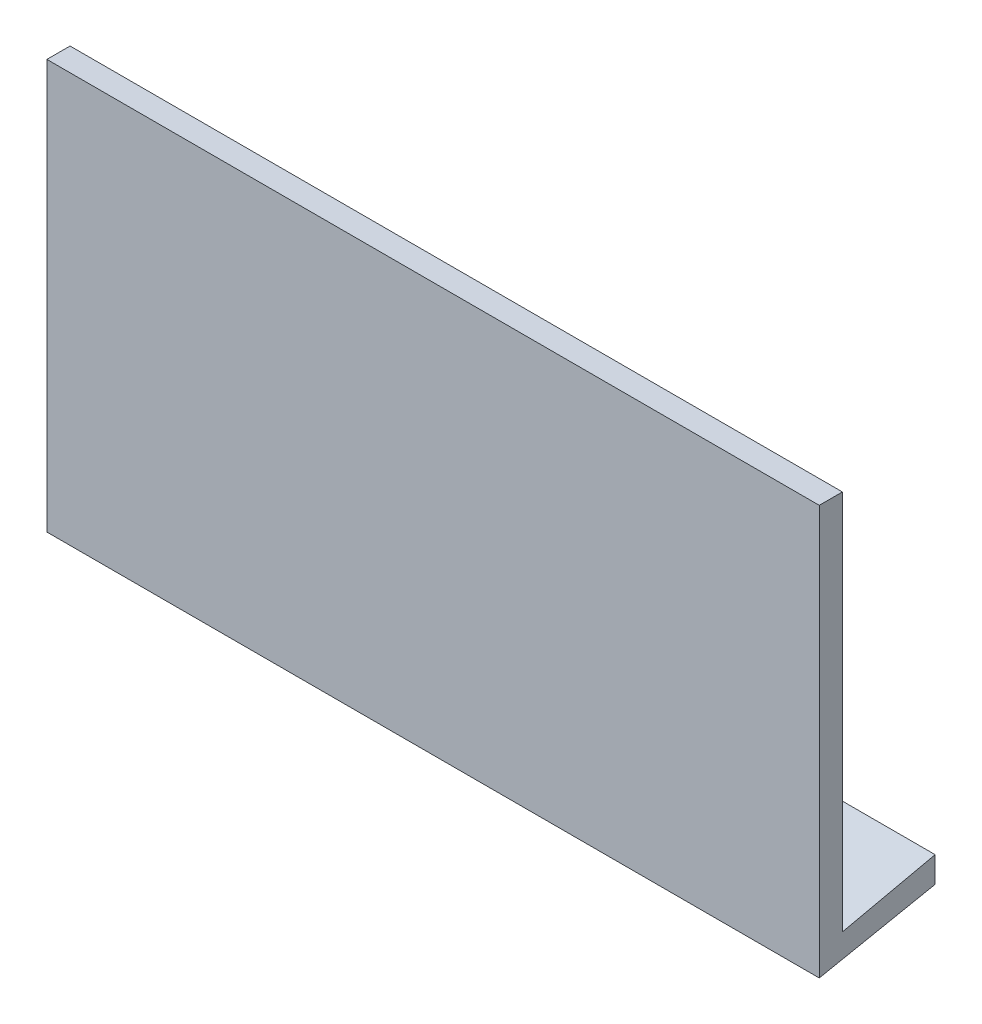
ISO-10303-21;
HEADER;
FILE_DESCRIPTION(('STEP AP214'),'2;1');
FILE_NAME('part.step','',(''),(''),'','','');
FILE_SCHEMA(('AUTOMOTIVE_DESIGN { 1 0 10303 214 1 1 1 1 }'));
ENDSEC;
DATA;
#1=APPLICATION_CONTEXT('core data for automotive mechanical design processes');
#2=APPLICATION_PROTOCOL_DEFINITION('international standard','automotive_design',2000,#1);
#3=PRODUCT_CONTEXT('',#1,'mechanical');
#4=PRODUCT('Part','Part','',(#3));
#5=PRODUCT_RELATED_PRODUCT_CATEGORY('part','',(#4));
#6=PRODUCT_DEFINITION_FORMATION('','',#4);
#7=PRODUCT_DEFINITION_CONTEXT('part definition',#1,'design');
#8=PRODUCT_DEFINITION('design','',#6,#7);
#9=PRODUCT_DEFINITION_SHAPE('','',#8);
#10=(LENGTH_UNIT() NAMED_UNIT(*) SI_UNIT(.MILLI.,.METRE.));
#11=(NAMED_UNIT(*) PLANE_ANGLE_UNIT() SI_UNIT($,.RADIAN.));
#12=(NAMED_UNIT(*) SI_UNIT($,.STERADIAN.) SOLID_ANGLE_UNIT());
#13=UNCERTAINTY_MEASURE_WITH_UNIT(LENGTH_MEASURE(1.E-05),#10,'distance_accuracy_value','');
#14=(GEOMETRIC_REPRESENTATION_CONTEXT(3) GLOBAL_UNCERTAINTY_ASSIGNED_CONTEXT((#13)) GLOBAL_UNIT_ASSIGNED_CONTEXT((#10,
#11,#12)) REPRESENTATION_CONTEXT('',''));
#15=CARTESIAN_POINT('',(0.,0.,0.));
#16=DIRECTION('',(0.,0.,1.));
#17=DIRECTION('',(1.,0.,0.));
#18=AXIS2_PLACEMENT_3D('',#15,#16,#17);
#19=CARTESIAN_POINT('',(-299.950280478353,0.,18.));
#20=DIRECTION('',(1.,0.,0.));
#21=DIRECTION('',(0.,0.,-1.));
#22=AXIS2_PLACEMENT_3D('',#19,#20,#21);
#23=PLANE('',#22);
#24=DIRECTION('',(0.,-1.,0.));
#25=VECTOR('',#24,1.);
#26=CARTESIAN_POINT('',(-299.950280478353,0.,0.));
#27=LINE('',#26,#25);
#28=CARTESIAN_POINT('',(-299.950280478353,0.,0.));
#29=VERTEX_POINT('',#28);
#30=CARTESIAN_POINT('',(-299.950280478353,-296.000000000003,0.));
#31=VERTEX_POINT('',#30);
#32=EDGE_CURVE('E83',#29,#31,#27,.T.);
#33=ORIENTED_EDGE('',*,*,#32,.T.);
#34=DIRECTION('',(0.,-0.216930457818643,0.976187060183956));
#35=VECTOR('',#34,1.);
#36=CARTESIAN_POINT('',(-299.950280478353,-280.000000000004,-72.0000000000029));
#37=LINE('',#36,#35);
#38=CARTESIAN_POINT('',(-299.950280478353,-280.000000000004,-72.0000000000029));
#39=VERTEX_POINT('',#38);
#40=EDGE_CURVE('E101',#39,#31,#37,.T.);
#41=ORIENTED_EDGE('',*,*,#40,.F.);
#42=DIRECTION('',(0.,1.,0.));
#43=VECTOR('',#42,1.);
#44=CARTESIAN_POINT('',(-299.950280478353,-300.000000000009,-72.0000000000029));
#45=LINE('',#44,#43);
#46=CARTESIAN_POINT('',(-299.950280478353,-300.000000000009,-72.0000000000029));
#47=VERTEX_POINT('',#46);
#48=EDGE_CURVE('E113',#47,#39,#45,.T.);
#49=ORIENTED_EDGE('',*,*,#48,.F.);
#50=DIRECTION('',(0.,0.196116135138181,-0.980580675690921));
#51=VECTOR('',#50,1.);
#52=CARTESIAN_POINT('',(-299.950280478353,-318.000000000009,18.0000000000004));
#53=LINE('',#52,#51);
#54=CARTESIAN_POINT('',(-299.950280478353,-318.000000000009,18.0000000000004));
#55=VERTEX_POINT('',#54);
#56=EDGE_CURVE('E105',#55,#47,#53,.T.);
#57=ORIENTED_EDGE('',*,*,#56,.F.);
#58=DIRECTION('',(0.,-1.,0.));
#59=VECTOR('',#58,1.);
#60=CARTESIAN_POINT('',(-299.950280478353,0.,18.));
#61=LINE('',#60,#59);
#62=CARTESIAN_POINT('',(-299.950280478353,0.,18.));
#63=VERTEX_POINT('',#62);
#64=EDGE_CURVE('E77',#63,#55,#61,.T.);
#65=ORIENTED_EDGE('',*,*,#64,.F.);
#66=DIRECTION('',(0.,0.,-1.));
#67=VECTOR('',#66,1.);
#68=CARTESIAN_POINT('',(-299.950280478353,0.,18.));
#69=LINE('',#68,#67);
#70=EDGE_CURVE('E71',#63,#29,#69,.T.);
#71=ORIENTED_EDGE('',*,*,#70,.T.);
#72=EDGE_LOOP('',(#33,#41,#49,#57,#65,#71));
#73=FACE_BOUND('',#72,.T.);
#74=ADVANCED_FACE('F33',(#73),#23,.F.);
#75=CARTESIAN_POINT('',(300.049719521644,0.,18.));
#76=DIRECTION('',(-1.,0.,0.));
#77=DIRECTION('',(0.,-1.,0.));
#78=AXIS2_PLACEMENT_3D('',#75,#76,#77);
#79=PLANE('',#78);
#80=DIRECTION('',(0.,1.,0.));
#81=VECTOR('',#80,1.);
#82=CARTESIAN_POINT('',(300.049719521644,0.,18.));
#83=LINE('',#82,#81);
#84=CARTESIAN_POINT('',(300.049719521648,-318.000000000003,18.0000000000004));
#85=VERTEX_POINT('',#84);
#86=CARTESIAN_POINT('',(300.049719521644,0.,18.));
#87=VERTEX_POINT('',#86);
#88=EDGE_CURVE('E95',#85,#87,#83,.T.);
#89=ORIENTED_EDGE('',*,*,#88,.F.);
#90=DIRECTION('',(0.,0.196116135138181,-0.980580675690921));
#91=VECTOR('',#90,1.);
#92=CARTESIAN_POINT('',(300.049719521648,-318.000000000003,18.0000000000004));
#93=LINE('',#92,#91);
#94=CARTESIAN_POINT('',(300.049719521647,-300.000000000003,-72.0000000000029));
#95=VERTEX_POINT('',#94);
#96=EDGE_CURVE('E108',#85,#95,#93,.T.);
#97=ORIENTED_EDGE('',*,*,#96,.T.);
#98=DIRECTION('',(0.,1.,0.));
#99=VECTOR('',#98,1.);
#100=CARTESIAN_POINT('',(300.049719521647,-300.000000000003,-72.0000000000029));
#101=LINE('',#100,#99);
#102=CARTESIAN_POINT('',(300.049719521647,-279.999999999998,-72.0000000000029));
#103=VERTEX_POINT('',#102);
#104=EDGE_CURVE('E106',#95,#103,#101,.T.);
#105=ORIENTED_EDGE('',*,*,#104,.T.);
#106=DIRECTION('',(0.,-0.216930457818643,0.976187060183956));
#107=VECTOR('',#106,1.);
#108=CARTESIAN_POINT('',(300.049719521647,-279.999999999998,-72.0000000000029));
#109=LINE('',#108,#107);
#110=CARTESIAN_POINT('',(300.049719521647,-295.999999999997,0.));
#111=VERTEX_POINT('',#110);
#112=EDGE_CURVE('E47',#103,#111,#109,.T.);
#113=ORIENTED_EDGE('',*,*,#112,.T.);
#114=DIRECTION('',(0.,1.,0.));
#115=VECTOR('',#114,1.);
#116=CARTESIAN_POINT('',(300.049719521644,0.,0.));
#117=LINE('',#116,#115);
#118=CARTESIAN_POINT('',(300.049719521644,0.,0.));
#119=VERTEX_POINT('',#118);
#120=EDGE_CURVE('E78',#111,#119,#117,.T.);
#121=ORIENTED_EDGE('',*,*,#120,.T.);
#122=DIRECTION('',(0.,0.,-1.));
#123=VECTOR('',#122,1.);
#124=CARTESIAN_POINT('',(300.049719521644,0.,18.));
#125=LINE('',#124,#123);
#126=EDGE_CURVE('E40',#87,#119,#125,.T.);
#127=ORIENTED_EDGE('',*,*,#126,.F.);
#128=EDGE_LOOP('',(#89,#97,#105,#113,#121,#127));
#129=FACE_BOUND('',#128,.T.);
#130=ADVANCED_FACE('F142',(#129),#79,.F.);
#131=CARTESIAN_POINT('',(-299.950280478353,0.,18.));
#132=DIRECTION('',(0.,-1.,0.));
#133=DIRECTION('',(0.,0.,-1.));
#134=AXIS2_PLACEMENT_3D('',#131,#132,#133);
#135=PLANE('',#134);
#136=DIRECTION('',(-1.,0.,0.));
#137=VECTOR('',#136,1.);
#138=CARTESIAN_POINT('',(-299.950280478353,0.,0.));
#139=LINE('',#138,#137);
#140=EDGE_CURVE('E68',#119,#29,#139,.T.);
#141=ORIENTED_EDGE('',*,*,#140,.T.);
#142=ORIENTED_EDGE('',*,*,#70,.F.);
#143=DIRECTION('',(-1.,0.,0.));
#144=VECTOR('',#143,1.);
#145=CARTESIAN_POINT('',(-299.950280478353,0.,18.));
#146=LINE('',#145,#144);
#147=EDGE_CURVE('E56',#87,#63,#146,.T.);
#148=ORIENTED_EDGE('',*,*,#147,.F.);
#149=ORIENTED_EDGE('',*,*,#126,.T.);
#150=EDGE_LOOP('',(#141,#142,#148,#149));
#151=FACE_BOUND('',#150,.T.);
#152=ADVANCED_FACE('F70',(#151),#135,.F.);
#153=CARTESIAN_POINT('',(0.,0.,18.));
#154=DIRECTION('',(0.,0.,1.));
#155=DIRECTION('',(1.,0.,0.));
#156=AXIS2_PLACEMENT_3D('',#153,#154,#155);
#157=PLANE('',#156);
#158=ORIENTED_EDGE('',*,*,#64,.T.);
#159=DIRECTION('',(1.,0.,0.));
#160=VECTOR('',#159,1.);
#161=CARTESIAN_POINT('',(-299.950280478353,-318.000000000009,18.0000000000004));
#162=LINE('',#161,#160);
#163=EDGE_CURVE('E98',#55,#85,#162,.T.);
#164=ORIENTED_EDGE('',*,*,#163,.T.);
#165=ORIENTED_EDGE('',*,*,#88,.T.);
#166=ORIENTED_EDGE('',*,*,#147,.T.);
#167=EDGE_LOOP('',(#158,#164,#165,#166));
#168=FACE_BOUND('',#167,.T.);
#169=ADVANCED_FACE('F143',(#168),#157,.T.);
#170=CARTESIAN_POINT('',(0.,0.,0.));
#171=DIRECTION('',(0.,0.,1.));
#172=DIRECTION('',(1.,0.,0.));
#173=AXIS2_PLACEMENT_3D('',#170,#171,#172);
#174=PLANE('',#173);
#175=ORIENTED_EDGE('',*,*,#120,.F.);
#176=DIRECTION('',(-1.,0.,0.));
#177=VECTOR('',#176,1.);
#178=CARTESIAN_POINT('',(2.90286313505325E-12,-296.,0.));
#179=LINE('',#178,#177);
#180=EDGE_CURVE('E11',#111,#31,#179,.T.);
#181=ORIENTED_EDGE('',*,*,#180,.T.);
#182=ORIENTED_EDGE('',*,*,#32,.F.);
#183=ORIENTED_EDGE('',*,*,#140,.F.);
#184=EDGE_LOOP('',(#175,#181,#182,#183));
#185=FACE_BOUND('',#184,.T.);
#186=ADVANCED_FACE('F86',(#185),#174,.F.);
#187=CARTESIAN_POINT('',(-299.950280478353,-280.000000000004,-72.0000000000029));
#188=DIRECTION('',(0.,0.976187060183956,0.216930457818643));
#189=DIRECTION('',(0.,-0.216930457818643,0.976187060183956));
#190=AXIS2_PLACEMENT_3D('',#187,#188,#189);
#191=PLANE('',#190);
#192=ORIENTED_EDGE('',*,*,#180,.F.);
#193=ORIENTED_EDGE('',*,*,#112,.F.);
#194=DIRECTION('',(1.,0.,0.));
#195=VECTOR('',#194,1.);
#196=CARTESIAN_POINT('',(-299.950280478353,-280.000000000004,-72.0000000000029));
#197=LINE('',#196,#195);
#198=EDGE_CURVE('E87',#39,#103,#197,.T.);
#199=ORIENTED_EDGE('',*,*,#198,.F.);
#200=ORIENTED_EDGE('',*,*,#40,.T.);
#201=EDGE_LOOP('',(#192,#193,#199,#200));
#202=FACE_BOUND('',#201,.T.);
#203=ADVANCED_FACE('F139',(#202),#191,.T.);
#204=CARTESIAN_POINT('',(-299.950280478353,-300.000000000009,-72.0000000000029));
#205=DIRECTION('',(0.,0.,-1.));
#206=DIRECTION('',(-1.,0.,0.));
#207=AXIS2_PLACEMENT_3D('',#204,#205,#206);
#208=PLANE('',#207);
#209=ORIENTED_EDGE('',*,*,#104,.F.);
#210=DIRECTION('',(1.,0.,0.));
#211=VECTOR('',#210,1.);
#212=CARTESIAN_POINT('',(-299.950280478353,-300.000000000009,-72.0000000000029));
#213=LINE('',#212,#211);
#214=EDGE_CURVE('E91',#47,#95,#213,.T.);
#215=ORIENTED_EDGE('',*,*,#214,.F.);
#216=ORIENTED_EDGE('',*,*,#48,.T.);
#217=ORIENTED_EDGE('',*,*,#198,.T.);
#218=EDGE_LOOP('',(#209,#215,#216,#217));
#219=FACE_BOUND('',#218,.T.);
#220=ADVANCED_FACE('F141',(#219),#208,.T.);
#221=CARTESIAN_POINT('',(-299.950280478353,-318.000000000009,18.0000000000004));
#222=DIRECTION('',(0.,-0.980580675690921,-0.196116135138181));
#223=DIRECTION('',(0.,0.196116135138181,-0.980580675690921));
#224=AXIS2_PLACEMENT_3D('',#221,#222,#223);
#225=PLANE('',#224);
#226=ORIENTED_EDGE('',*,*,#96,.F.);
#227=ORIENTED_EDGE('',*,*,#163,.F.);
#228=ORIENTED_EDGE('',*,*,#56,.T.);
#229=ORIENTED_EDGE('',*,*,#214,.T.);
#230=EDGE_LOOP('',(#226,#227,#228,#229));
#231=FACE_BOUND('',#230,.T.);
#232=ADVANCED_FACE('F121',(#231),#225,.T.);
#233=CLOSED_SHELL('',(#74,#130,#152,#169,#186,#203,#220,#232));
#234=MANIFOLD_SOLID_BREP('B2',#233);
#235=ADVANCED_BREP_SHAPE_REPRESENTATION('',(#18,#234),#14);
#236=SHAPE_DEFINITION_REPRESENTATION(#9,#235);
ENDSEC;
END-ISO-10303-21;
